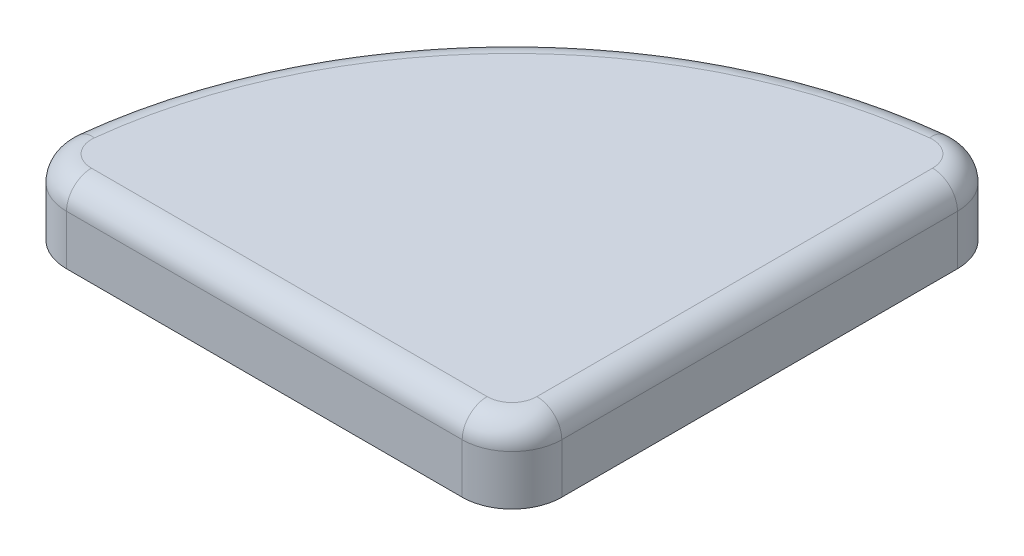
from build123d import *

# Parameters (mm, degrees)
EXTRUDE_2_DEPTH     = 3
FILLET_1_R          = 1
CUT_EXTRUDE_1_DEPTH = 1
SKETCH_3_W          = 5
SKETCH_3_H          = 1
EXTRUDE_1_DEPTH     = 2
SKETCH_4_W          = 2.6
SKETCH_4_H          = 4.3
EXTRUDE_2_2_DEPTH   = 7
EXTRUDE_2_2_TAPER   = 0.5
FILLET_2_R          = 1


with BuildPart() as part:
    # Sketch 1 → Extrude 2 (new body)
    with BuildSketch(Plane(origin=(0, 0, 0), x_dir=(0, 0, -1), z_dir=(0, 1, 0))):
        with BuildLine():
            Line((0, 2), (0, 17.88854382))
            ThreePointArc((0, 17.88854382), (0.666666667, 19.379255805), (2.222222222, 19.8761598))
            ThreePointArc((2.222222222, 19.8761598), (14.142135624, 14.142135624), (19.8761598, 2.222222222))
            ThreePointArc((19.8761598, 2.222222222), (19.379255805, 0.666666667), (17.88854382, 0))
            Line((17.88854382, 0), (2, 0))
            ThreePointArc((2, 0), (0.585786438, 0.585786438), (0, 2))
        make_face()
    extrude(amount=EXTRUDE_2_DEPTH)

    # Fillet 1
    fillet_1_edges = [part.edges().sort_by_distance(p)[0] for p in [
        (-9.94427191, 3, 0),
        (-0.585786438, 3, -0.585786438),
        (0, 3, -9.94427191),
        (-0.666666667, 3, -19.379255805),
        (-14.142135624, 3, -14.142135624),
        (-19.379255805, 3, -0.666666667),
    ]]
    fillet(fillet_1_edges, radius=FILLET_1_R)

    # Sketch 2 → Cut-Extrude 1 (cut)
    with BuildSketch(Plane.XZ):
        with BuildLine():
            Line((-17.88854382, -1.2), (-2, -1.2))
            ThreePointArc((-2, -1.2), (-1.434314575, -1.434314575), (-1.2, -2))
            Line((-1.2, -2), (-1.2, -17.88854382))
            ThreePointArc((-1.2, -17.88854382), (-1.466666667, -18.484828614), (-2.088888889, -18.683590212))
            ThreePointArc((-2.088888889, -18.683590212), (-13.293607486, -13.293607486), (-18.683590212, -2.088888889))
            ThreePointArc((-18.683590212, -2.088888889), (-18.484828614, -1.466666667), (-17.88854382, -1.2))
        make_face()
    extrude(amount=-CUT_EXTRUDE_1_DEPTH, mode=Mode.SUBTRACT)

    # Sketch 3 → Extrude 1 (add)
    with BuildSketch(Plane.XZ.offset(-1)):
        with Locations((-10, -1.7)):
            Rectangle(SKETCH_3_W, SKETCH_3_H)
    extrude(amount=EXTRUDE_1_DEPTH)

    # Sketch 4 → Extrude 2 2 (add)
    with BuildSketch(Plane.XZ.offset(-1)):
        with Locations((-10, -10)):
            Rectangle(SKETCH_4_W, SKETCH_4_H)
    extrude(amount=EXTRUDE_2_2_DEPTH, taper=EXTRUDE_2_2_TAPER)

    # Fillet 2
    fillet_2_edges = [part.edges().sort_by_distance(p)[0] for p in [
        (-11.238911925, -6, -10),
        (-10, -6, -12.088911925),
        (-8.761088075, -6, -10),
        (-10, -6, -7.911088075),
    ]]
    fillet(fillet_2_edges, radius=FILLET_2_R)


solid = part.part
